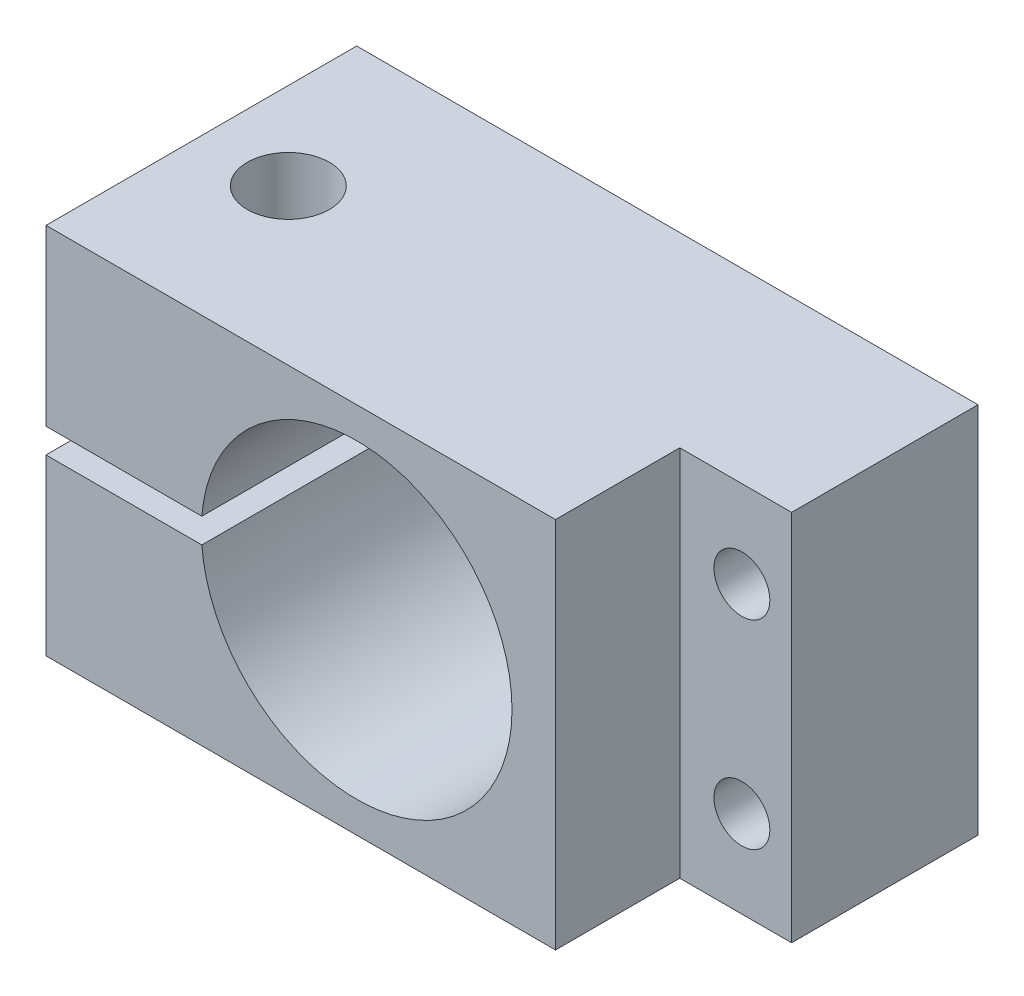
from build123d import *

# Parameters (mm, degrees)
BOSS_EXTRU_1_DEPTH           = 12.5
BOSS_EXTRU_1_DEPTH_BACK      = 12.5
ESQUISSE1_W                  = 50
ESQUISSE1_H                  = 30
ENL_V_MAT_EXTRU_1_DEPTH      = 12.5
ENL_V_MAT_EXTRU_1_DEPTH_BACK = 12.5
ENL_V_MAT_EXTRU_2_DEPTH      = 16
ENL_V_MAT_EXTRU_2_DEPTH_BACK = 16
ESQUISSE3_W                  = 10
ESQUISSE3_H                  = 11
ESQUISSE4_R                  = 2.25
ENL_V_MAT_EXTRU_3_DEPTH      = 16
ESQUISSE5_R                  = 2.25
ENL_V_MAT_EXTRU_4_DEPTH      = 16


with BuildPart() as part:
    # Esquisse1 → Boss.-Extru.1 (new, two sides: drawn at the far end of the back side and taken through both)
    with BuildSketch(Plane.XY.offset(-BOSS_EXTRU_1_DEPTH_BACK)):
        Rectangle(ESQUISSE1_W, ESQUISSE1_H)
    extrude(amount=BOSS_EXTRU_1_DEPTH + BOSS_EXTRU_1_DEPTH_BACK)

    # Esquisse2 → Enl_v. mat.-Extru.1 (cut, two sides: drawn at the far end of the back side and taken through both)
    with BuildSketch(Plane.XY.offset(-ENL_V_MAT_EXTRU_1_DEPTH_BACK)):
        with BuildLine():
            Line((-26, 1), (-26, -1))
            Line((-26, -1), (-12.459935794, -1))
            ThreePointArc((-12.459935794, -1), (12.5, 0), (-12.459935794, 1))
            Line((-12.459935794, 1), (-26, 1))
        make_face()
    extrude(amount=ENL_V_MAT_EXTRU_1_DEPTH + ENL_V_MAT_EXTRU_1_DEPTH_BACK, mode=Mode.SUBTRACT)

    # Esquisse3 → Enl_v. mat.-Extru.2 (cut, two sides: drawn at the far end of the back side and taken through both)
    with BuildSketch(Plane(origin=(0, 0, 0), x_dir=(-1, 0, 0), z_dir=(0, 1, 0)).offset(-ENL_V_MAT_EXTRU_2_DEPTH_BACK)):
        with Locations((-21, 8)):
            Rectangle(ESQUISSE3_W, ESQUISSE3_H)
    extrude(amount=ENL_V_MAT_EXTRU_2_DEPTH + ENL_V_MAT_EXTRU_2_DEPTH_BACK, mode=Mode.SUBTRACT)

    # Esquisse4 → Enl_v. mat.-Extru.3 (cut)
    with BuildSketch(Plane.XY.offset(2.5)):
        with Locations((21, 8)):
            Circle(ESQUISSE4_R)
    extrude(amount=-ENL_V_MAT_EXTRU_3_DEPTH, mode=Mode.SUBTRACT)

    # Esquisse5 → Enl_v. mat.-Extru.4 (cut)
    with BuildSketch(Plane.XY.offset(2.5)):
        with Locations((21, -8)):
            Circle(ESQUISSE5_R)
    extrude(amount=-ENL_V_MAT_EXTRU_4_DEPTH, mode=Mode.SUBTRACT)

    # Esquisse6 → Enl_vement de mati_re-R_volution1 (revolve, cut)
    with BuildSketch(Plane.XY, mode=Mode.PRIVATE) as enl_vement_de_mati_re_r_volution1_sk:
        Polygon((-18, 15), (-14.7, 15), (-14.7, 0), (-15.5415, 0), (-15.5415, -14.4585), (-15, -15), (-18, -15), align=None)
    revolve(enl_vement_de_mati_re_r_volution1_sk.sketch.rotate(Axis((-18, -15, 0), (0, 1, 0)), 270), axis=Axis((-18, -15, 0), (0, 1, 0)), mode=Mode.SUBTRACT)


solid = part.part
